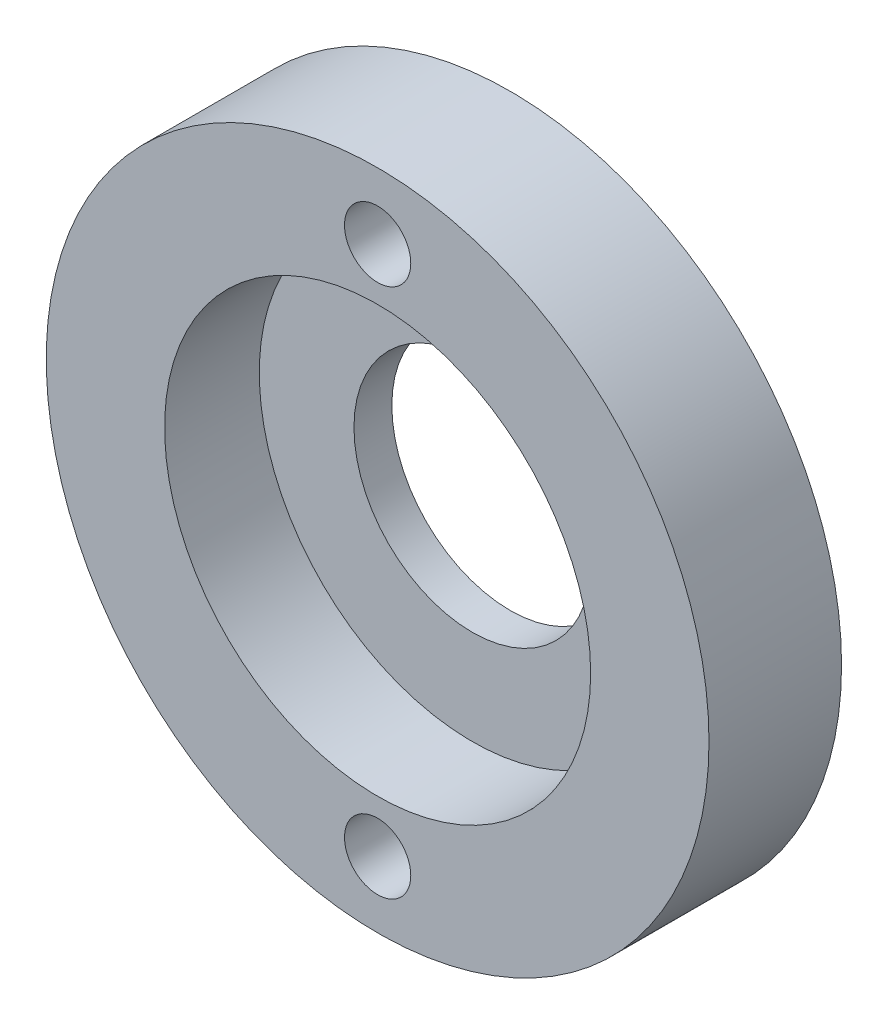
ISO-10303-21;
HEADER;
FILE_DESCRIPTION(('STEP AP214'),'2;1');
FILE_NAME('part.step','',(''),(''),'','','');
FILE_SCHEMA(('AUTOMOTIVE_DESIGN { 1 0 10303 214 1 1 1 1 }'));
ENDSEC;
DATA;
#1=APPLICATION_CONTEXT('core data for automotive mechanical design processes');
#2=APPLICATION_PROTOCOL_DEFINITION('international standard','automotive_design',2000,#1);
#3=PRODUCT_CONTEXT('',#1,'mechanical');
#4=PRODUCT('Part','Part','',(#3));
#5=PRODUCT_RELATED_PRODUCT_CATEGORY('part','',(#4));
#6=PRODUCT_DEFINITION_FORMATION('','',#4);
#7=PRODUCT_DEFINITION_CONTEXT('part definition',#1,'design');
#8=PRODUCT_DEFINITION('design','',#6,#7);
#9=PRODUCT_DEFINITION_SHAPE('','',#8);
#10=(LENGTH_UNIT() NAMED_UNIT(*) SI_UNIT(.MILLI.,.METRE.));
#11=(NAMED_UNIT(*) PLANE_ANGLE_UNIT() SI_UNIT($,.RADIAN.));
#12=(NAMED_UNIT(*) SI_UNIT($,.STERADIAN.) SOLID_ANGLE_UNIT());
#13=UNCERTAINTY_MEASURE_WITH_UNIT(LENGTH_MEASURE(1.E-05),#10,'distance_accuracy_value','');
#14=(GEOMETRIC_REPRESENTATION_CONTEXT(3) GLOBAL_UNCERTAINTY_ASSIGNED_CONTEXT((#13)) GLOBAL_UNIT_ASSIGNED_CONTEXT((#10,
#11,#12)) REPRESENTATION_CONTEXT('',''));
#15=CARTESIAN_POINT('',(0.,0.,0.));
#16=DIRECTION('',(0.,0.,1.));
#17=DIRECTION('',(1.,0.,0.));
#18=AXIS2_PLACEMENT_3D('',#15,#16,#17);
#19=CARTESIAN_POINT('',(0.,0.,14.));
#20=DIRECTION('',(0.,0.,-1.));
#21=DIRECTION('',(-1.,0.,0.));
#22=AXIS2_PLACEMENT_3D('',#19,#20,#21);
#23=CYLINDRICAL_SURFACE('',#22,12.5);
#24=CARTESIAN_POINT('',(0.,0.,0.));
#25=DIRECTION('',(0.,0.,1.));
#26=DIRECTION('',(1.,0.,0.));
#27=AXIS2_PLACEMENT_3D('',#24,#25,#26);
#28=CIRCLE('',#27,12.5);
#29=CARTESIAN_POINT('',(12.5,0.,0.));
#30=VERTEX_POINT('',#29);
#31=EDGE_CURVE('E27',#30,#30,#28,.T.);
#32=ORIENTED_EDGE('',*,*,#31,.F.);
#33=EDGE_LOOP('',(#32));
#34=FACE_BOUND('',#33,.T.);
#35=CARTESIAN_POINT('',(0.,0.,4.));
#36=DIRECTION('',(0.,0.,1.));
#37=DIRECTION('',(1.,0.,0.));
#38=AXIS2_PLACEMENT_3D('',#35,#36,#37);
#39=CIRCLE('',#38,12.5);
#40=CARTESIAN_POINT('',(12.5,0.,4.00000000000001));
#41=VERTEX_POINT('',#40);
#42=EDGE_CURVE('E19',#41,#41,#39,.T.);
#43=ORIENTED_EDGE('',*,*,#42,.T.);
#44=EDGE_LOOP('',(#43));
#45=FACE_BOUND('',#44,.T.);
#46=ADVANCED_FACE('F15',(#34,#45),#23,.F.);
#47=CARTESIAN_POINT('',(0.,0.,14.));
#48=DIRECTION('',(0.,0.,1.));
#49=DIRECTION('',(1.,0.,0.));
#50=AXIS2_PLACEMENT_3D('',#47,#48,#49);
#51=PLANE('',#50);
#52=CARTESIAN_POINT('',(0.,0.,14.));
#53=DIRECTION('',(0.,0.,1.));
#54=DIRECTION('',(1.,0.,0.));
#55=AXIS2_PLACEMENT_3D('',#52,#53,#54);
#56=CIRCLE('',#55,22.5);
#57=CARTESIAN_POINT('',(22.5,0.,14.));
#58=VERTEX_POINT('',#57);
#59=EDGE_CURVE('E47',#58,#58,#56,.T.);
#60=ORIENTED_EDGE('',*,*,#59,.F.);
#61=EDGE_LOOP('',(#60));
#62=FACE_BOUND('',#61,.T.);
#63=CARTESIAN_POINT('',(-1.11022302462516E-13,28.,14.));
#64=DIRECTION('',(0.,0.,1.));
#65=DIRECTION('',(1.,0.,0.));
#66=AXIS2_PLACEMENT_3D('',#63,#64,#65);
#67=CIRCLE('',#66,3.5);
#68=CARTESIAN_POINT('',(3.49999999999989,28.,14.));
#69=VERTEX_POINT('',#68);
#70=EDGE_CURVE('E32',#69,#69,#67,.T.);
#71=ORIENTED_EDGE('',*,*,#70,.F.);
#72=EDGE_LOOP('',(#71));
#73=FACE_BOUND('',#72,.T.);
#74=CARTESIAN_POINT('',(0.,0.,14.));
#75=DIRECTION('',(0.,0.,1.));
#76=DIRECTION('',(1.,0.,0.));
#77=AXIS2_PLACEMENT_3D('',#74,#75,#76);
#78=CIRCLE('',#77,35.);
#79=CARTESIAN_POINT('',(35.,0.,14.));
#80=VERTEX_POINT('',#79);
#81=EDGE_CURVE('E10',#80,#80,#78,.T.);
#82=ORIENTED_EDGE('',*,*,#81,.T.);
#83=EDGE_LOOP('',(#82));
#84=FACE_BOUND('',#83,.T.);
#85=CARTESIAN_POINT('',(1.66533453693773E-13,-28.,14.0000000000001));
#86=DIRECTION('',(0.,0.,1.));
#87=DIRECTION('',(1.,0.,0.));
#88=AXIS2_PLACEMENT_3D('',#85,#86,#87);
#89=CIRCLE('',#88,3.5);
#90=CARTESIAN_POINT('',(3.50000000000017,-28.,14.0000000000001));
#91=VERTEX_POINT('',#90);
#92=EDGE_CURVE('E38',#91,#91,#89,.T.);
#93=ORIENTED_EDGE('',*,*,#92,.F.);
#94=EDGE_LOOP('',(#93));
#95=FACE_BOUND('',#94,.T.);
#96=ADVANCED_FACE('F53',(#62,#73,#84,#95),#51,.T.);
#97=CARTESIAN_POINT('',(0.,0.,0.));
#98=DIRECTION('',(0.,0.,1.));
#99=DIRECTION('',(1.,0.,0.));
#100=AXIS2_PLACEMENT_3D('',#97,#98,#99);
#101=PLANE('',#100);
#102=CARTESIAN_POINT('',(-1.66533453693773E-13,28.,0.));
#103=DIRECTION('',(0.,0.,1.));
#104=DIRECTION('',(1.,0.,0.));
#105=AXIS2_PLACEMENT_3D('',#102,#103,#104);
#106=CIRCLE('',#105,3.5);
#107=CARTESIAN_POINT('',(3.49999999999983,28.,0.));
#108=VERTEX_POINT('',#107);
#109=EDGE_CURVE('E35',#108,#108,#106,.T.);
#110=ORIENTED_EDGE('',*,*,#109,.T.);
#111=EDGE_LOOP('',(#110));
#112=FACE_BOUND('',#111,.T.);
#113=CARTESIAN_POINT('',(0.,0.,0.));
#114=DIRECTION('',(0.,0.,1.));
#115=DIRECTION('',(1.,0.,0.));
#116=AXIS2_PLACEMENT_3D('',#113,#114,#115);
#117=CIRCLE('',#116,35.);
#118=CARTESIAN_POINT('',(35.,0.,0.));
#119=VERTEX_POINT('',#118);
#120=EDGE_CURVE('E23',#119,#119,#117,.T.);
#121=ORIENTED_EDGE('',*,*,#120,.F.);
#122=EDGE_LOOP('',(#121));
#123=FACE_BOUND('',#122,.T.);
#124=ORIENTED_EDGE('',*,*,#31,.T.);
#125=EDGE_LOOP('',(#124));
#126=FACE_BOUND('',#125,.T.);
#127=CARTESIAN_POINT('',(1.11022302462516E-13,-28.,1.11022302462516E-13));
#128=DIRECTION('',(0.,0.,1.));
#129=DIRECTION('',(1.,0.,0.));
#130=AXIS2_PLACEMENT_3D('',#127,#128,#129);
#131=CIRCLE('',#130,3.5);
#132=CARTESIAN_POINT('',(3.50000000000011,-28.,1.13199845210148E-13));
#133=VERTEX_POINT('',#132);
#134=EDGE_CURVE('E41',#133,#133,#131,.T.);
#135=ORIENTED_EDGE('',*,*,#134,.T.);
#136=EDGE_LOOP('',(#135));
#137=FACE_BOUND('',#136,.T.);
#138=ADVANCED_FACE('F56',(#112,#123,#126,#137),#101,.F.);
#139=CARTESIAN_POINT('',(0.,0.,14.));
#140=DIRECTION('',(0.,0.,-1.));
#141=DIRECTION('',(-1.,0.,0.));
#142=AXIS2_PLACEMENT_3D('',#139,#140,#141);
#143=CYLINDRICAL_SURFACE('',#142,35.);
#144=ORIENTED_EDGE('',*,*,#81,.F.);
#145=EDGE_LOOP('',(#144));
#146=FACE_BOUND('',#145,.T.);
#147=ORIENTED_EDGE('',*,*,#120,.T.);
#148=EDGE_LOOP('',(#147));
#149=FACE_BOUND('',#148,.T.);
#150=ADVANCED_FACE('F17',(#146,#149),#143,.T.);
#151=CARTESIAN_POINT('',(-1.11022302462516E-13,28.,14.));
#152=DIRECTION('',(0.,0.,-1.));
#153=DIRECTION('',(-1.,0.,0.));
#154=AXIS2_PLACEMENT_3D('',#151,#152,#153);
#155=CYLINDRICAL_SURFACE('',#154,3.5);
#156=ORIENTED_EDGE('',*,*,#70,.T.);
#157=EDGE_LOOP('',(#156));
#158=FACE_BOUND('',#157,.T.);
#159=ORIENTED_EDGE('',*,*,#109,.F.);
#160=EDGE_LOOP('',(#159));
#161=FACE_BOUND('',#160,.T.);
#162=ADVANCED_FACE('F64',(#158,#161),#155,.F.);
#163=CARTESIAN_POINT('',(1.66533453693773E-13,-28.,14.0000000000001));
#164=DIRECTION('',(0.,0.,-1.));
#165=DIRECTION('',(-1.,0.,0.));
#166=AXIS2_PLACEMENT_3D('',#163,#164,#165);
#167=CYLINDRICAL_SURFACE('',#166,3.5);
#168=ORIENTED_EDGE('',*,*,#92,.T.);
#169=EDGE_LOOP('',(#168));
#170=FACE_BOUND('',#169,.T.);
#171=ORIENTED_EDGE('',*,*,#134,.F.);
#172=EDGE_LOOP('',(#171));
#173=FACE_BOUND('',#172,.T.);
#174=ADVANCED_FACE('F61',(#170,#173),#167,.F.);
#175=CARTESIAN_POINT('',(0.,0.,4.));
#176=DIRECTION('',(0.,0.,1.));
#177=DIRECTION('',(1.,0.,0.));
#178=AXIS2_PLACEMENT_3D('',#175,#176,#177);
#179=CYLINDRICAL_SURFACE('',#178,22.5);
#180=CARTESIAN_POINT('',(0.,0.,4.));
#181=DIRECTION('',(0.,0.,1.));
#182=DIRECTION('',(1.,0.,0.));
#183=AXIS2_PLACEMENT_3D('',#180,#181,#182);
#184=CIRCLE('',#183,22.5);
#185=CARTESIAN_POINT('',(22.5,0.,4.00000000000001));
#186=VERTEX_POINT('',#185);
#187=EDGE_CURVE('E44',#186,#186,#184,.T.);
#188=ORIENTED_EDGE('',*,*,#187,.F.);
#189=EDGE_LOOP('',(#188));
#190=FACE_BOUND('',#189,.T.);
#191=ORIENTED_EDGE('',*,*,#59,.T.);
#192=EDGE_LOOP('',(#191));
#193=FACE_BOUND('',#192,.T.);
#194=ADVANCED_FACE('F51',(#190,#193),#179,.F.);
#195=CARTESIAN_POINT('',(0.,0.,4.));
#196=DIRECTION('',(0.,0.,1.));
#197=DIRECTION('',(1.,0.,0.));
#198=AXIS2_PLACEMENT_3D('',#195,#196,#197);
#199=PLANE('',#198);
#200=ORIENTED_EDGE('',*,*,#42,.F.);
#201=EDGE_LOOP('',(#200));
#202=FACE_BOUND('',#201,.T.);
#203=ORIENTED_EDGE('',*,*,#187,.T.);
#204=EDGE_LOOP('',(#203));
#205=FACE_BOUND('',#204,.T.);
#206=ADVANCED_FACE('F92',(#202,#205),#199,.T.);
#207=CLOSED_SHELL('',(#46,#96,#138,#150,#162,#174,#194,#206));
#208=MANIFOLD_SOLID_BREP('B1',#207);
#209=ADVANCED_BREP_SHAPE_REPRESENTATION('',(#18,#208),#14);
#210=SHAPE_DEFINITION_REPRESENTATION(#9,#209);
ENDSEC;
END-ISO-10303-21;
